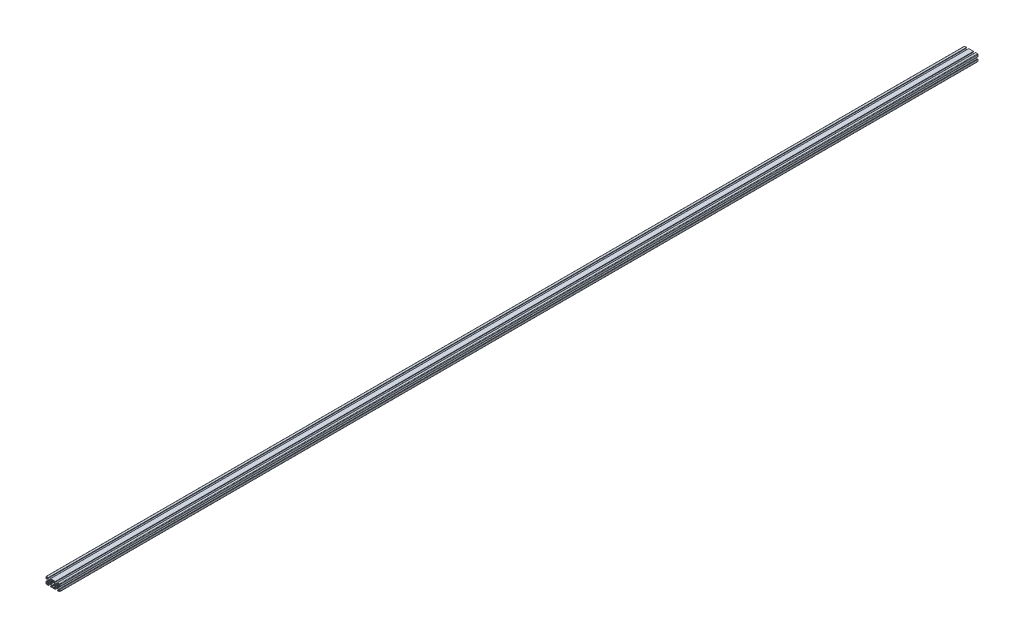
from build123d import *

# Parameters (mm, degrees)
EXTRUDE1_DEPTH = 4000


with BuildPart() as part:
    # Sketch1 → Extrude1 (new body)
    with BuildSketch(Plane.XY):
        with BuildLine():
            Line((-10.428, -15), (10.428, -15))
            ThreePointArc((10.428, -15), (10.787210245, -14.851210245), (10.936, -14.492))
            Line((10.936, -14.492), (10.936, -13.2982))
            ThreePointArc((10.936, -13.2982), (10.787210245, -12.938989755), (10.428, -12.7902))
            Line((10.428, -12.7902), (7.253, -12.7902))
            ThreePointArc((7.253, -12.7902), (6.893789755, -12.641410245), (6.745, -12.2822))
            Line((6.745, -12.2822), (6.745, -10.261471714))
            ThreePointArc((6.745, -10.261471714), (6.783669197, -10.06706853), (6.893789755, -9.902261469))
            Line((6.893789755, -9.902261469), (10.825246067, -5.970805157))
            ThreePointArc((10.825246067, -5.970805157), (10.990053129, -5.860684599), (11.184456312, -5.822015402))
            Line((11.184456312, -5.822015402), (14.0475, -5.822015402))
            Line((14.0475, -5.822015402), (15, -5.314015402))
            Line((15, -5.314015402), (15.9525, -5.822015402))
            Line((15.9525, -5.822015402), (18.815543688, -5.822015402))
            ThreePointArc((18.815543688, -5.822015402), (19.009946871, -5.860684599), (19.174753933, -5.970805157))
            Line((19.174753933, -5.970805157), (23.106210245, -9.902261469))
            ThreePointArc((23.106210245, -9.902261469), (23.216330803, -10.06706853), (23.255, -10.261471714))
            Line((23.255, -10.261471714), (23.255, -12.2822))
            ThreePointArc((23.255, -12.2822), (23.106210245, -12.641410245), (22.747, -12.7902))
            Line((22.747, -12.7902), (19.572, -12.7902))
            ThreePointArc((19.572, -12.7902), (19.212789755, -12.938989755), (19.064, -13.2982))
            Line((19.064, -13.2982), (19.064, -14.492))
            ThreePointArc((19.064, -14.492), (19.212789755, -14.851210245), (19.572, -15))
            Line((19.572, -15), (27.9934, -15))
            ThreePointArc((27.9934, -15), (29.412280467, -14.412280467), (30, -12.9934))
            Line((30, -12.9934), (30, -4.572))
            ThreePointArc((30, -4.572), (29.851210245, -4.212789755), (29.492, -4.064))
            Line((29.492, -4.064), (28.2982, -4.064))
            ThreePointArc((28.2982, -4.064), (27.938989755, -4.212789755), (27.7902, -4.572))
            Line((27.7902, -4.572), (27.7902, -7.747))
            ThreePointArc((27.7902, -7.747), (27.641410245, -8.106210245), (27.2822, -8.255))
            Line((27.2822, -8.255), (25.261471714, -8.255))
            ThreePointArc((25.261471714, -8.255), (25.06706853, -8.216330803), (24.902261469, -8.106210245))
            Line((24.902261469, -8.106210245), (20.970805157, -4.174753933))
            ThreePointArc((20.970805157, -4.174753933), (20.860684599, -4.009946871), (20.822015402, -3.815543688))
            Line((20.822015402, -3.815543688), (20.822015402, -0.9525))
            Line((20.822015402, -0.9525), (20.314015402, 0))
            Line((20.314015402, 0), (20.822015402, 0.9525))
            Line((20.822015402, 0.9525), (20.822015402, 3.815543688))
            ThreePointArc((20.822015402, 3.815543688), (20.860684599, 4.009946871), (20.970805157, 4.174753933))
            Line((20.970805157, 4.174753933), (24.902261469, 8.106210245))
            ThreePointArc((24.902261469, 8.106210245), (25.06706853, 8.216330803), (25.261471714, 8.255))
            Line((25.261471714, 8.255), (27.2822, 8.255))
            ThreePointArc((27.2822, 8.255), (27.641410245, 8.106210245), (27.7902, 7.747))
            Line((27.7902, 7.747), (27.7902, 4.572))
            ThreePointArc((27.7902, 4.572), (27.938989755, 4.212789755), (28.2982, 4.064))
            Line((28.2982, 4.064), (29.492, 4.064))
            ThreePointArc((29.492, 4.064), (29.851210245, 4.212789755), (30, 4.572))
            Line((30, 4.572), (30, 12.9934))
            ThreePointArc((30, 12.9934), (29.412280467, 14.412280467), (27.9934, 15))
            Line((27.9934, 15), (19.572, 15))
            ThreePointArc((19.572, 15), (19.212789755, 14.851210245), (19.064, 14.492))
            Line((19.064, 14.492), (19.064, 13.2982))
            ThreePointArc((19.064, 13.2982), (19.212789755, 12.938989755), (19.572, 12.7902))
            Line((19.572, 12.7902), (22.747, 12.7902))
            ThreePointArc((22.747, 12.7902), (23.106210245, 12.641410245), (23.255, 12.2822))
            Line((23.255, 12.2822), (23.255, 10.261471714))
            ThreePointArc((23.255, 10.261471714), (23.216330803, 10.06706853), (23.106210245, 9.902261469))
            Line((23.106210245, 9.902261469), (19.174753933, 5.970805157))
            ThreePointArc((19.174753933, 5.970805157), (19.009946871, 5.860684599), (18.815543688, 5.822015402))
            Line((18.815543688, 5.822015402), (15.9525, 5.822015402))
            Line((15.9525, 5.822015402), (15, 5.314015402))
            Line((15, 5.314015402), (14.0475, 5.822015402))
            Line((14.0475, 5.822015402), (11.184456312, 5.822015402))
            ThreePointArc((11.184456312, 5.822015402), (10.990053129, 5.860684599), (10.825246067, 5.970805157))
            Line((10.825246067, 5.970805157), (6.893789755, 9.902261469))
            ThreePointArc((6.893789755, 9.902261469), (6.783669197, 10.06706853), (6.745, 10.261471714))
            Line((6.745, 10.261471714), (6.745, 12.2822))
            ThreePointArc((6.745, 12.2822), (6.893789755, 12.641410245), (7.253, 12.7902))
            Line((7.253, 12.7902), (10.428, 12.7902))
            ThreePointArc((10.428, 12.7902), (10.787210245, 12.938989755), (10.936, 13.2982))
            Line((10.936, 13.2982), (10.936, 14.492))
            ThreePointArc((10.936, 14.492), (10.787210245, 14.851210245), (10.428, 15))
            Line((10.428, 15), (-10.428, 15))
            ThreePointArc((-10.428, 15), (-10.787210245, 14.851210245), (-10.936, 14.492))
            Line((-10.936, 14.492), (-10.936, 13.2982))
            ThreePointArc((-10.936, 13.2982), (-10.787210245, 12.938989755), (-10.428, 12.7902))
            Line((-10.428, 12.7902), (-7.253, 12.7902))
            ThreePointArc((-7.253, 12.7902), (-6.893789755, 12.641410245), (-6.745, 12.2822))
            Line((-6.745, 12.2822), (-6.745, 10.261471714))
            ThreePointArc((-6.745, 10.261471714), (-6.783669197, 10.06706853), (-6.893789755, 9.902261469))
            Line((-6.893789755, 9.902261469), (-10.825246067, 5.970805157))
            ThreePointArc((-10.825246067, 5.970805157), (-10.990053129, 5.860684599), (-11.184456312, 5.822015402))
            Line((-11.184456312, 5.822015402), (-14.0475, 5.822015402))
            Line((-14.0475, 5.822015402), (-15, 5.314015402))
            Line((-15, 5.314015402), (-15.9525, 5.822015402))
            Line((-15.9525, 5.822015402), (-18.815543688, 5.822015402))
            ThreePointArc((-18.815543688, 5.822015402), (-19.009946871, 5.860684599), (-19.174753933, 5.970805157))
            Line((-19.174753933, 5.970805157), (-23.106210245, 9.902261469))
            ThreePointArc((-23.106210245, 9.902261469), (-23.216330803, 10.06706853), (-23.255, 10.261471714))
            Line((-23.255, 10.261471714), (-23.255, 12.2822))
            ThreePointArc((-23.255, 12.2822), (-23.106210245, 12.641410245), (-22.747, 12.7902))
            Line((-22.747, 12.7902), (-19.572, 12.7902))
            ThreePointArc((-19.572, 12.7902), (-19.212789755, 12.938989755), (-19.064, 13.2982))
            Line((-19.064, 13.2982), (-19.064, 14.492))
            ThreePointArc((-19.064, 14.492), (-19.212789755, 14.851210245), (-19.572, 15))
            Line((-19.572, 15), (-27.9934, 15))
            ThreePointArc((-27.9934, 15), (-29.412280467, 14.412280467), (-30, 12.9934))
            Line((-30, 12.9934), (-30, 4.572))
            ThreePointArc((-30, 4.572), (-29.851210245, 4.212789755), (-29.492, 4.064))
            Line((-29.492, 4.064), (-28.2982, 4.064))
            ThreePointArc((-28.2982, 4.064), (-27.938989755, 4.212789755), (-27.7902, 4.572))
            Line((-27.7902, 4.572), (-27.7902, 7.747))
            ThreePointArc((-27.7902, 7.747), (-27.641410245, 8.106210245), (-27.2822, 8.255))
            Line((-27.2822, 8.255), (-25.261471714, 8.255))
            ThreePointArc((-25.261471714, 8.255), (-25.06706853, 8.216330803), (-24.902261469, 8.106210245))
            Line((-24.902261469, 8.106210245), (-20.970805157, 4.174753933))
            ThreePointArc((-20.970805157, 4.174753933), (-20.860684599, 4.009946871), (-20.822015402, 3.815543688))
            Line((-20.822015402, 3.815543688), (-20.822015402, 0.9525))
            Line((-20.822015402, 0.9525), (-20.314015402, 0))
            Line((-20.314015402, 0), (-20.822015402, -0.9525))
            Line((-20.822015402, -0.9525), (-20.822015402, -3.815543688))
            ThreePointArc((-20.822015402, -3.815543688), (-20.860684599, -4.009946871), (-20.970805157, -4.174753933))
            Line((-20.970805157, -4.174753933), (-24.902261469, -8.106210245))
            ThreePointArc((-24.902261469, -8.106210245), (-25.06706853, -8.216330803), (-25.261471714, -8.255))
            Line((-25.261471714, -8.255), (-27.2822, -8.255))
            ThreePointArc((-27.2822, -8.255), (-27.641410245, -8.106210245), (-27.7902, -7.747))
            Line((-27.7902, -7.747), (-27.7902, -4.572))
            ThreePointArc((-27.7902, -4.572), (-27.938989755, -4.212789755), (-28.2982, -4.064))
            Line((-28.2982, -4.064), (-29.492, -4.064))
            ThreePointArc((-29.492, -4.064), (-29.851210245, -4.212789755), (-30, -4.572))
            Line((-30, -4.572), (-30, -12.9934))
            ThreePointArc((-30, -12.9934), (-29.412280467, -14.412280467), (-27.9934, -15))
            Line((-27.9934, -15), (-19.572, -15))
            ThreePointArc((-19.572, -15), (-19.212789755, -14.851210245), (-19.064, -14.492))
            Line((-19.064, -14.492), (-19.064, -13.2982))
            ThreePointArc((-19.064, -13.2982), (-19.212789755, -12.938989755), (-19.572, -12.7902))
            Line((-19.572, -12.7902), (-22.747, -12.7902))
            ThreePointArc((-22.747, -12.7902), (-23.106210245, -12.641410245), (-23.255, -12.2822))
            Line((-23.255, -12.2822), (-23.255, -10.261471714))
            ThreePointArc((-23.255, -10.261471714), (-23.216330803, -10.06706853), (-23.106210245, -9.902261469))
            Line((-23.106210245, -9.902261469), (-19.174753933, -5.970805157))
            ThreePointArc((-19.174753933, -5.970805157), (-19.009946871, -5.860684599), (-18.815543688, -5.822015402))
            Line((-18.815543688, -5.822015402), (-15.9525, -5.822015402))
            Line((-15.9525, -5.822015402), (-15, -5.314015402))
            Line((-15, -5.314015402), (-14.0475, -5.822015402))
            Line((-14.0475, -5.822015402), (-11.184456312, -5.822015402))
            ThreePointArc((-11.184456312, -5.822015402), (-10.990053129, -5.860684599), (-10.825246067, -5.970805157))
            Line((-10.825246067, -5.970805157), (-6.893789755, -9.902261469))
            ThreePointArc((-6.893789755, -9.902261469), (-6.783669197, -10.06706853), (-6.745, -10.261471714))
            Line((-6.745, -10.261471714), (-6.745, -12.2822))
            ThreePointArc((-6.745, -12.2822), (-6.893789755, -12.641410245), (-7.253, -12.7902))
            Line((-7.253, -12.7902), (-10.428, -12.7902))
            ThreePointArc((-10.428, -12.7902), (-10.787210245, -12.938989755), (-10.936, -13.2982))
            Line((-10.936, -13.2982), (-10.936, -14.492))
            ThreePointArc((-10.936, -14.492), (-10.787210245, -14.851210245), (-10.428, -15))
        make_face()
        with BuildLine():
            Line((12.782541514, 3.726141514), (13.525717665, 2.982965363))
            ThreePointArc((13.525717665, 2.982965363), (15, 3.3274), (16.474282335, 2.982965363))
            Line((16.474282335, 2.982965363), (17.217458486, 3.726141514))
            ThreePointArc((17.217458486, 3.726141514), (18.726141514, 3.726141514), (18.726141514, 2.217458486))
            Line((18.726141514, 2.217458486), (17.982965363, 1.474282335))
            ThreePointArc((17.982965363, 1.474282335), (18.3274, 0), (17.982965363, -1.474282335))
            Line((17.982965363, -1.474282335), (18.726141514, -2.217458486))
            ThreePointArc((18.726141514, -2.217458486), (18.726141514, -3.726141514), (17.217458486, -3.726141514))
            Line((17.217458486, -3.726141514), (16.474282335, -2.982965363))
            ThreePointArc((16.474282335, -2.982965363), (15, -3.3274), (13.525717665, -2.982965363))
            Line((13.525717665, -2.982965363), (12.782541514, -3.726141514))
            ThreePointArc((12.782541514, -3.726141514), (11.273858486, -3.726141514), (11.273858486, -2.217458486))
            Line((11.273858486, -2.217458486), (12.017034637, -1.474282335))
            ThreePointArc((12.017034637, -1.474282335), (11.6726, 0), (12.017034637, 1.474282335))
            Line((12.017034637, 1.474282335), (11.273858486, 2.217458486))
            ThreePointArc((11.273858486, 2.217458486), (11.273858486, 3.726141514), (12.782541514, 3.726141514))
        make_face(mode=Mode.SUBTRACT)
        with BuildLine():
            Line((-28.7046, 9.8946), (-28.7046, 12.6886))
            ThreePointArc((-28.7046, 12.6886), (-28.40702049, 13.40702049), (-27.6886, 13.7046))
            Line((-27.6886, 13.7046), (-24.8946, 13.7046))
            ThreePointArc((-24.8946, 13.7046), (-24.625192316, 13.593007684), (-24.5136, 13.3236))
            Line((-24.5136, 13.3236), (-24.5136, 9.8946))
            ThreePointArc((-24.5136, 9.8946), (-24.625192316, 9.625192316), (-24.8946, 9.5136))
            Line((-24.8946, 9.5136), (-28.3236, 9.5136))
            ThreePointArc((-28.3236, 9.5136), (-28.593007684, 9.625192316), (-28.7046, 9.8946))
        make_face(mode=Mode.SUBTRACT)
        with BuildLine():
            Line((-24.8946, -13.7046), (-27.6886, -13.7046))
            ThreePointArc((-27.6886, -13.7046), (-28.40702049, -13.40702049), (-28.7046, -12.6886))
            Line((-28.7046, -12.6886), (-28.7046, -9.8946))
            ThreePointArc((-28.7046, -9.8946), (-28.593007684, -9.625192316), (-28.3236, -9.5136))
            Line((-28.3236, -9.5136), (-24.8946, -9.5136))
            ThreePointArc((-24.8946, -9.5136), (-24.625192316, -9.625192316), (-24.5136, -9.8946))
            Line((-24.5136, -9.8946), (-24.5136, -13.3236))
            ThreePointArc((-24.5136, -13.3236), (-24.625192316, -13.593007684), (-24.8946, -13.7046))
        make_face(mode=Mode.SUBTRACT)
        with BuildLine():
            Line((4.981569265, 8.22237951), (9.029194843, 4.174753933))
            ThreePointArc((9.029194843, 4.174753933), (9.139315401, 4.009946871), (9.177984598, 3.815543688))
            Line((9.177984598, 3.815543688), (9.177984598, 0.9525))
            Line((9.177984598, 0.9525), (9.685984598, 0))
            Line((9.685984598, 0), (9.177984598, -0.9525))
            Line((9.177984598, -0.9525), (9.177984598, -3.815543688))
            ThreePointArc((9.177984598, -3.815543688), (9.139315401, -4.009946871), (9.029194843, -4.174753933))
            Line((9.029194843, -4.174753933), (4.981569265, -8.22237951))
            ThreePointArc((4.981569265, -8.22237951), (4.651207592, -8.716800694), (4.5352, -9.300010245))
            Line((4.5352, -9.300010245), (4.5352, -12.4092))
            ThreePointArc((4.5352, -12.4092), (4.423607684, -12.678607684), (4.1542, -12.7902))
            Line((4.1542, -12.7902), (-4.1542, -12.7902))
            ThreePointArc((-4.1542, -12.7902), (-4.423607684, -12.678607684), (-4.5352, -12.4092))
            Line((-4.5352, -12.4092), (-4.5352, -9.300010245))
            ThreePointArc((-4.5352, -9.300010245), (-4.651207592, -8.716800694), (-4.981569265, -8.22237951))
            Line((-4.981569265, -8.22237951), (-9.029194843, -4.174753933))
            ThreePointArc((-9.029194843, -4.174753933), (-9.139315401, -4.009946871), (-9.177984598, -3.815543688))
            Line((-9.177984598, -3.815543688), (-9.177984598, -0.9525))
            Line((-9.177984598, -0.9525), (-9.685984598, 0))
            Line((-9.685984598, 0), (-9.177984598, 0.9525))
            Line((-9.177984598, 0.9525), (-9.177984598, 3.815543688))
            ThreePointArc((-9.177984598, 3.815543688), (-9.139315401, 4.009946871), (-9.029194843, 4.174753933))
            Line((-9.029194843, 4.174753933), (-4.981569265, 8.22237951))
            ThreePointArc((-4.981569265, 8.22237951), (-4.651207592, 8.716800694), (-4.5352, 9.300010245))
            Line((-4.5352, 9.300010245), (-4.5352, 12.4092))
            ThreePointArc((-4.5352, 12.4092), (-4.423607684, 12.678607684), (-4.1542, 12.7902))
            Line((-4.1542, 12.7902), (4.1542, 12.7902))
            ThreePointArc((4.1542, 12.7902), (4.423607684, 12.678607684), (4.5352, 12.4092))
            Line((4.5352, 12.4092), (4.5352, 9.300010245))
            ThreePointArc((4.5352, 9.300010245), (4.651207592, 8.716800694), (4.981569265, 8.22237951))
        make_face(mode=Mode.SUBTRACT)
        with BuildLine():
            Line((-18.726141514, -2.217458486), (-17.982965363, -1.474282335))
            ThreePointArc((-17.982965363, -1.474282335), (-18.3274, 0), (-17.982965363, 1.474282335))
            Line((-17.982965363, 1.474282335), (-18.726141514, 2.217458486))
            ThreePointArc((-18.726141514, 2.217458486), (-18.726141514, 3.726141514), (-17.217458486, 3.726141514))
            Line((-17.217458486, 3.726141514), (-16.474282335, 2.982965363))
            ThreePointArc((-16.474282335, 2.982965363), (-15, 3.3274), (-13.525717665, 2.982965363))
            Line((-13.525717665, 2.982965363), (-12.782541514, 3.726141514))
            ThreePointArc((-12.782541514, 3.726141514), (-11.273858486, 3.726141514), (-11.273858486, 2.217458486))
            Line((-11.273858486, 2.217458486), (-12.017034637, 1.474282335))
            ThreePointArc((-12.017034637, 1.474282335), (-11.6726, 0), (-12.017034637, -1.474282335))
            Line((-12.017034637, -1.474282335), (-11.273858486, -2.217458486))
            ThreePointArc((-11.273858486, -2.217458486), (-11.273858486, -3.726141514), (-12.782541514, -3.726141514))
            Line((-12.782541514, -3.726141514), (-13.525717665, -2.982965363))
            ThreePointArc((-13.525717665, -2.982965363), (-15, -3.3274), (-16.474282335, -2.982965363))
            Line((-16.474282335, -2.982965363), (-17.217458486, -3.726141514))
            ThreePointArc((-17.217458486, -3.726141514), (-18.726141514, -3.726141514), (-18.726141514, -2.217458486))
        make_face(mode=Mode.SUBTRACT)
        with BuildLine():
            Line((24.8946, 13.7046), (27.6886, 13.7046))
            ThreePointArc((27.6886, 13.7046), (28.40702049, 13.40702049), (28.7046, 12.6886))
            Line((28.7046, 12.6886), (28.7046, 9.8946))
            ThreePointArc((28.7046, 9.8946), (28.593007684, 9.625192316), (28.3236, 9.5136))
            Line((28.3236, 9.5136), (24.8946, 9.5136))
            ThreePointArc((24.8946, 9.5136), (24.625192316, 9.625192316), (24.5136, 9.8946))
            Line((24.5136, 9.8946), (24.5136, 13.3236))
            ThreePointArc((24.5136, 13.3236), (24.625192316, 13.593007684), (24.8946, 13.7046))
        make_face(mode=Mode.SUBTRACT)
        with BuildLine():
            Line((24.5136, -13.3236), (24.5136, -9.8946))
            ThreePointArc((24.5136, -9.8946), (24.625192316, -9.625192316), (24.8946, -9.5136))
            Line((24.8946, -9.5136), (28.3236, -9.5136))
            ThreePointArc((28.3236, -9.5136), (28.593007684, -9.625192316), (28.7046, -9.8946))
            Line((28.7046, -9.8946), (28.7046, -12.6886))
            ThreePointArc((28.7046, -12.6886), (28.40702049, -13.40702049), (27.6886, -13.7046))
            Line((27.6886, -13.7046), (24.8946, -13.7046))
            ThreePointArc((24.8946, -13.7046), (24.625192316, -13.593007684), (24.5136, -13.3236))
        make_face(mode=Mode.SUBTRACT)
    extrude(amount=-EXTRUDE1_DEPTH)


solid = part.part
